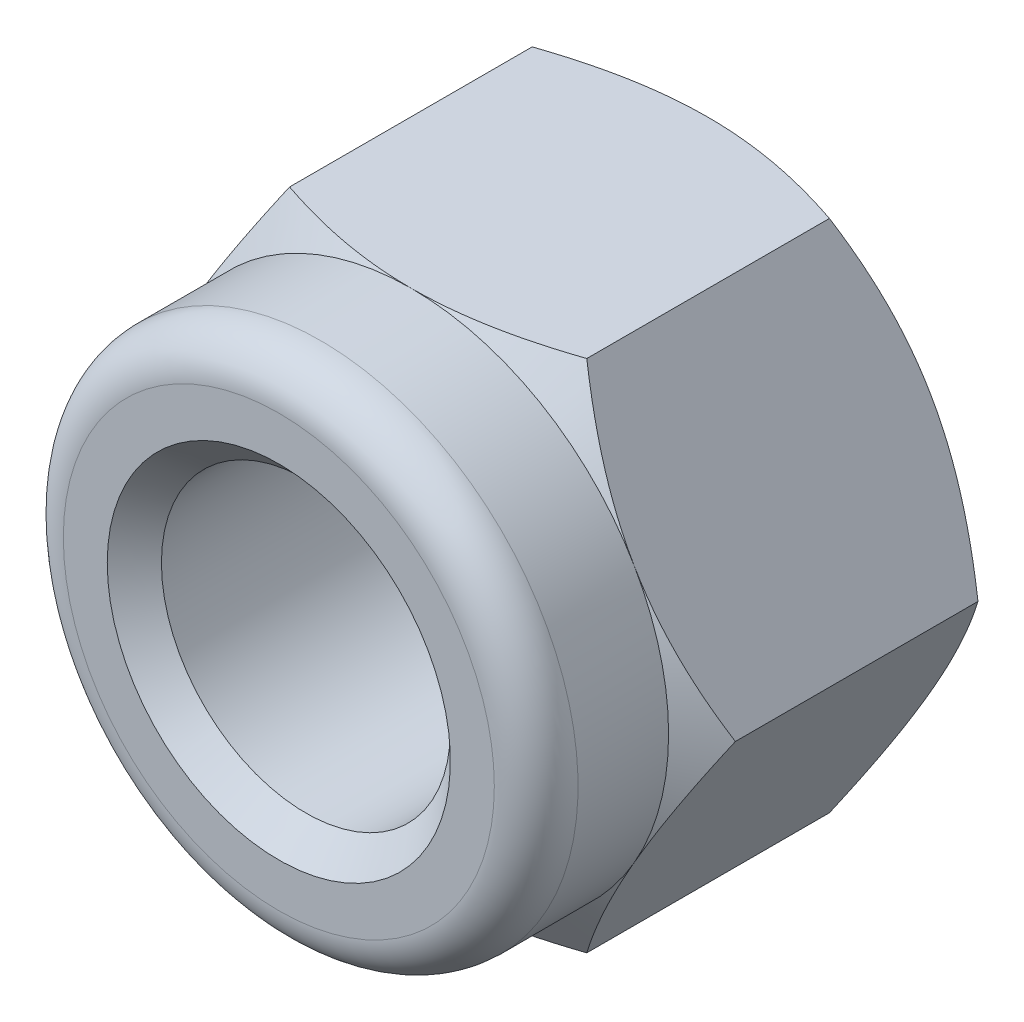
ISO-10303-21;
HEADER;
FILE_DESCRIPTION(('STEP AP214'),'2;1');
FILE_NAME('part.step','',(''),(''),'','','');
FILE_SCHEMA(('AUTOMOTIVE_DESIGN { 1 0 10303 214 1 1 1 1 }'));
ENDSEC;
DATA;
#1=APPLICATION_CONTEXT('core data for automotive mechanical design processes');
#2=APPLICATION_PROTOCOL_DEFINITION('international standard','automotive_design',2000,#1);
#3=PRODUCT_CONTEXT('',#1,'mechanical');
#4=PRODUCT('Part','Part','',(#3));
#5=PRODUCT_RELATED_PRODUCT_CATEGORY('part','',(#4));
#6=PRODUCT_DEFINITION_FORMATION('','',#4);
#7=PRODUCT_DEFINITION_CONTEXT('part definition',#1,'design');
#8=PRODUCT_DEFINITION('design','',#6,#7);
#9=PRODUCT_DEFINITION_SHAPE('','',#8);
#10=(LENGTH_UNIT() NAMED_UNIT(*) SI_UNIT(.MILLI.,.METRE.));
#11=(NAMED_UNIT(*) PLANE_ANGLE_UNIT() SI_UNIT($,.RADIAN.));
#12=(NAMED_UNIT(*) SI_UNIT($,.STERADIAN.) SOLID_ANGLE_UNIT());
#13=UNCERTAINTY_MEASURE_WITH_UNIT(LENGTH_MEASURE(1.E-05),#10,'distance_accuracy_value','');
#14=(GEOMETRIC_REPRESENTATION_CONTEXT(3) GLOBAL_UNCERTAINTY_ASSIGNED_CONTEXT((#13)) GLOBAL_UNIT_ASSIGNED_CONTEXT((#10,
#11,#12)) REPRESENTATION_CONTEXT('',''));
#15=CARTESIAN_POINT('',(0.,0.,0.));
#16=DIRECTION('',(0.,0.,1.));
#17=DIRECTION('',(1.,0.,0.));
#18=AXIS2_PLACEMENT_3D('',#15,#16,#17);
#19=CARTESIAN_POINT('',(-10.3923048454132,0.,10.37));
#20=DIRECTION('',(0.86602540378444,-0.499999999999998,0.));
#21=DIRECTION('',(0.499999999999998,0.86602540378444,0.));
#22=AXIS2_PLACEMENT_3D('',#19,#20,#21);
#23=PLANE('',#22);
#24=CARTESIAN_POINT('',(-10.3924203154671,-0.00019999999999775,9.42719454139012));
#25=CARTESIAN_POINT('',(-10.2764029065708,0.200748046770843,9.50574215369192));
#26=CARTESIAN_POINT('',(-10.1597703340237,0.402761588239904,9.58078081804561));
#27=CARTESIAN_POINT('',(-9.92519945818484,0.809050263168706,9.72275951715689));
#28=CARTESIAN_POINT('',(-9.80726035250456,1.01332678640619,9.78969423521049));
#29=CARTESIAN_POINT('',(-9.56974021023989,1.4247237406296,9.91449543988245));
#30=CARTESIAN_POINT('',(-9.45015489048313,1.63185159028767,9.97232958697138));
#31=CARTESIAN_POINT('',(-9.2098593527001,2.04805567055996,10.0774315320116));
#32=CARTESIAN_POINT('',(-9.08914949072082,2.25713128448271,10.1247025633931));
#33=CARTESIAN_POINT('',(-8.85083681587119,2.66990094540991,10.2061503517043));
#34=CARTESIAN_POINT('',(-8.73326753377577,2.87353691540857,10.2407169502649));
#35=CARTESIAN_POINT('',(-8.49740229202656,3.28206749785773,10.2980508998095));
#36=CARTESIAN_POINT('',(-8.37910631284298,3.4869621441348,10.3208179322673));
#37=CARTESIAN_POINT('',(-8.14228994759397,3.89714012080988,10.3538759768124));
#38=CARTESIAN_POINT('',(-8.0237703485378,4.10242208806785,10.3641893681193));
#39=CARTESIAN_POINT('',(-7.78662856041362,4.51316371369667,10.3721053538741));
#40=CARTESIAN_POINT('',(-7.66800637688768,4.71862336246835,10.3697085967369));
#41=CARTESIAN_POINT('',(-7.45072742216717,5.09496155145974,10.353732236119));
#42=CARTESIAN_POINT('',(-7.35203399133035,5.2659035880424,10.3420804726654));
#43=CARTESIAN_POINT('',(-7.15498835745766,5.60719663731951,10.3102495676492));
#44=CARTESIAN_POINT('',(-7.0566361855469,5.77754759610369,10.2900696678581));
#45=CARTESIAN_POINT('',(-6.76211080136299,6.28768052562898,10.2172283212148));
#46=CARTESIAN_POINT('',(-6.56667274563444,6.6261891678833,10.1522815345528));
#47=CARTESIAN_POINT('',(-6.17303719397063,7.30798594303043,9.99174825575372));
#48=CARTESIAN_POINT('',(-5.97492949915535,7.65111853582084,9.89531098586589));
#49=CARTESIAN_POINT('',(-5.58263770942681,8.3305878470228,9.6781246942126));
#50=CARTESIAN_POINT('',(-5.38844426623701,8.66694075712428,9.55744375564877));
#51=CARTESIAN_POINT('',(-5.19603695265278,9.0002,9.4271945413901));
#52=B_SPLINE_CURVE_WITH_KNOTS('',3,(#24,#25,#26,#27,#28,#29,#30,#31,#32,#33,#34,#35,#36,#37,#38,
#39,#40,#41,#42,#43,#44,#45,#46,#47,#48,#49,#50,#51),.UNSPECIFIED.,.F.,.F.,(4,2,2,2,2,2,2,2,2,2,
2,2,2,4),(0.,0.734939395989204,1.47035837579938,2.20833441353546,2.94608424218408,
3.65880420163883,4.37154339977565,5.08299988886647,5.79442008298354,6.38742131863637,
6.98047528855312,8.16780437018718,9.39031146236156,10.6094322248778),.UNSPECIFIED.);
#53=CARTESIAN_POINT('',(-10.3923048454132,0.,9.42727272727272));
#54=VERTEX_POINT('',#53);
#55=CARTESIAN_POINT('',(-7.79422863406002,4.50000000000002,10.37));
#56=VERTEX_POINT('',#55);
#57=EDGE_CURVE('E142',#54,#56,#52,.T.);
#58=ORIENTED_EDGE('',*,*,#57,.T.);
#59=CARTESIAN_POINT('',(-5.19615242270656,9.,9.42727272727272));
#60=VERTEX_POINT('',#59);
#61=EDGE_CURVE('E148',#56,#60,#52,.T.);
#62=ORIENTED_EDGE('',*,*,#61,.T.);
#63=DIRECTION('',(0.,0.,-1.));
#64=VECTOR('',#63,1.);
#65=CARTESIAN_POINT('',(-5.19615242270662,9.,10.37));
#66=LINE('',#65,#64);
#67=CARTESIAN_POINT('',(-5.19615242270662,9.,0.942727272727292));
#68=VERTEX_POINT('',#67);
#69=EDGE_CURVE('E232',#60,#68,#66,.T.);
#70=ORIENTED_EDGE('',*,*,#69,.T.);
#71=CARTESIAN_POINT('',(-5.19603695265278,9.0002,0.942805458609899));
#72=CARTESIAN_POINT('',(-5.31205436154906,8.79925195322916,0.864257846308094));
#73=CARTESIAN_POINT('',(-5.42868693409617,8.5972384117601,0.789219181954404));
#74=CARTESIAN_POINT('',(-5.66325780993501,8.19094973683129,0.647240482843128));
#75=CARTESIAN_POINT('',(-5.78119691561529,7.98667321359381,0.580305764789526));
#76=CARTESIAN_POINT('',(-6.01871705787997,7.5752762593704,0.455504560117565));
#77=CARTESIAN_POINT('',(-6.13830237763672,7.36814840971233,0.397670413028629));
#78=CARTESIAN_POINT('',(-6.37859791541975,6.95194432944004,0.292568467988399));
#79=CARTESIAN_POINT('',(-6.49930777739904,6.74286871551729,0.245297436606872));
#80=CARTESIAN_POINT('',(-6.73762045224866,6.33009905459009,0.1638496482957));
#81=CARTESIAN_POINT('',(-6.85518973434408,6.12646308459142,0.129283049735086));
#82=CARTESIAN_POINT('',(-7.0910549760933,5.71793250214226,0.0719491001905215));
#83=CARTESIAN_POINT('',(-7.20935095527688,5.5130378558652,0.0491820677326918));
#84=CARTESIAN_POINT('',(-7.44616732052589,5.10285987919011,0.0161240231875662));
#85=CARTESIAN_POINT('',(-7.56468691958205,4.89757791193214,0.00581063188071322));
#86=CARTESIAN_POINT('',(-7.80182870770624,4.48683628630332,-0.00210535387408));
#87=CARTESIAN_POINT('',(-7.92045089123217,4.28137663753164,0.000291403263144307));
#88=CARTESIAN_POINT('',(-8.13772984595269,3.90503844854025,0.0162677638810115));
#89=CARTESIAN_POINT('',(-8.23642327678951,3.73409641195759,0.0279195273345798));
#90=CARTESIAN_POINT('',(-8.43346891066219,3.39280336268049,0.059750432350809));
#91=CARTESIAN_POINT('',(-8.53182108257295,3.2224524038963,0.0799303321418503));
#92=CARTESIAN_POINT('',(-8.82634646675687,2.71231947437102,0.1527716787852));
#93=CARTESIAN_POINT('',(-9.02178452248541,2.37381083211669,0.217718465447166));
#94=CARTESIAN_POINT('',(-9.41542007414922,1.69201405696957,0.378251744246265));
#95=CARTESIAN_POINT('',(-9.6135277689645,1.34888146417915,0.47468901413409));
#96=CARTESIAN_POINT('',(-10.005819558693,0.669412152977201,0.691875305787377));
#97=CARTESIAN_POINT('',(-10.2000130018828,0.333059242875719,0.812556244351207));
#98=CARTESIAN_POINT('',(-10.3924203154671,-0.000199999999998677,0.942805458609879));
#99=B_SPLINE_CURVE_WITH_KNOTS('',3,(#71,#72,#73,#74,#75,#76,#77,#78,#79,#80,#81,#82,#83,#84,#85,
#86,#87,#88,#89,#90,#91,#92,#93,#94,#95,#96,#97,#98),.UNSPECIFIED.,.F.,.F.,(4,2,2,2,2,2,2,2,2,2,
2,2,2,4),(0.,0.734939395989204,1.47035837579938,2.20833441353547,2.94608424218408,
3.65880420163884,4.37154339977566,5.08299988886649,5.79442008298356,6.38742131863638,
6.98047528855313,8.16780437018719,9.39031146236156,10.6094322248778),.UNSPECIFIED.);
#100=CARTESIAN_POINT('',(-7.79422863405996,4.49999999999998,0.));
#101=VERTEX_POINT('',#100);
#102=EDGE_CURVE('E231',#68,#101,#99,.T.);
#103=ORIENTED_EDGE('',*,*,#102,.T.);
#104=CARTESIAN_POINT('',(-10.3923048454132,0.,0.942727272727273));
#105=VERTEX_POINT('',#104);
#106=EDGE_CURVE('E225',#101,#105,#99,.T.);
#107=ORIENTED_EDGE('',*,*,#106,.T.);
#108=DIRECTION('',(0.,0.,-1.));
#109=VECTOR('',#108,1.);
#110=CARTESIAN_POINT('',(-10.3923048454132,0.,10.37));
#111=LINE('',#110,#109);
#112=EDGE_CURVE('E241',#54,#105,#111,.T.);
#113=ORIENTED_EDGE('',*,*,#112,.F.);
#114=EDGE_LOOP('',(#58,#62,#70,#103,#107,#113));
#115=FACE_BOUND('',#114,.T.);
#116=ADVANCED_FACE('F31',(#115),#23,.F.);
#117=CARTESIAN_POINT('',(-5.19615242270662,-8.99999999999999,10.37));
#118=DIRECTION('',(0.86602540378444,0.499999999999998,0.));
#119=DIRECTION('',(-0.499999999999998,0.86602540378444,0.));
#120=AXIS2_PLACEMENT_3D('',#117,#118,#119);
#121=PLANE('',#120);
#122=CARTESIAN_POINT('',(-5.19603695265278,-9.00019999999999,9.4271945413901));
#123=CARTESIAN_POINT('',(-5.31205436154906,-8.79925195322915,9.50574215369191));
#124=CARTESIAN_POINT('',(-5.42868693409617,-8.59723841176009,9.58078081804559));
#125=CARTESIAN_POINT('',(-5.66325780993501,-8.19094973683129,9.72275951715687));
#126=CARTESIAN_POINT('',(-5.78119691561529,-7.9866732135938,9.78969423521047));
#127=CARTESIAN_POINT('',(-6.01871705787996,-7.5752762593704,9.91449543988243));
#128=CARTESIAN_POINT('',(-6.13830237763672,-7.36814840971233,9.97232958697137));
#129=CARTESIAN_POINT('',(-6.37859791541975,-6.95194432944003,10.0774315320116));
#130=CARTESIAN_POINT('',(-6.49930777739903,-6.74286871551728,10.1247025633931));
#131=CARTESIAN_POINT('',(-6.73762045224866,-6.33009905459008,10.2061503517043));
#132=CARTESIAN_POINT('',(-6.85518973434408,-6.12646308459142,10.2407169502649));
#133=CARTESIAN_POINT('',(-7.0910549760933,-5.71793250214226,10.2980508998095));
#134=CARTESIAN_POINT('',(-7.20935095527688,-5.51303785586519,10.3208179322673));
#135=CARTESIAN_POINT('',(-7.44616732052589,-5.10285987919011,10.3538759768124));
#136=CARTESIAN_POINT('',(-7.56468691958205,-4.89757791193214,10.3641893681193));
#137=CARTESIAN_POINT('',(-7.80182870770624,-4.48683628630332,10.3721053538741));
#138=CARTESIAN_POINT('',(-7.92045089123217,-4.28137663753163,10.3697085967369));
#139=CARTESIAN_POINT('',(-8.13772984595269,-3.90503844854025,10.353732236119));
#140=CARTESIAN_POINT('',(-8.23642327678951,-3.73409641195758,10.3420804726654));
#141=CARTESIAN_POINT('',(-8.43346891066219,-3.39280336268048,10.3102495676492));
#142=CARTESIAN_POINT('',(-8.53182108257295,-3.2224524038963,10.2900696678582));
#143=CARTESIAN_POINT('',(-8.82634646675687,-2.71231947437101,10.2172283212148));
#144=CARTESIAN_POINT('',(-9.02178452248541,-2.37381083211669,10.1522815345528));
#145=CARTESIAN_POINT('',(-9.41542007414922,-1.69201405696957,9.99174825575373));
#146=CARTESIAN_POINT('',(-9.6135277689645,-1.34888146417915,9.89531098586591));
#147=CARTESIAN_POINT('',(-10.005819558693,-0.669412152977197,9.67812469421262));
#148=CARTESIAN_POINT('',(-10.2000130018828,-0.333059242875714,9.55744375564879));
#149=CARTESIAN_POINT('',(-10.3924203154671,0.000200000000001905,9.42719454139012));
#150=B_SPLINE_CURVE_WITH_KNOTS('',3,(#122,#123,#124,#125,#126,#127,#128,#129,#130,#131,#132,
#133,#134,#135,#136,#137,#138,#139,#140,#141,#142,#143,#144,#145,#146,#147,#148,#149),
.UNSPECIFIED.,.F.,.F.,(4,2,2,2,2,2,2,2,2,2,2,2,2,4),(0.,0.734939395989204,1.47035837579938,
2.20833441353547,2.94608424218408,3.65880420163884,4.37154339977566,5.08299988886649,
5.79442008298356,6.38742131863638,6.98047528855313,8.16780437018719,9.39031146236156,
10.6094322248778),.UNSPECIFIED.);
#151=CARTESIAN_POINT('',(-5.19615242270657,-8.99999999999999,9.42727272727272));
#152=VERTEX_POINT('',#151);
#153=CARTESIAN_POINT('',(-7.79422863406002,-4.50000000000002,10.37));
#154=VERTEX_POINT('',#153);
#155=EDGE_CURVE('E196',#152,#154,#150,.T.);
#156=ORIENTED_EDGE('',*,*,#155,.T.);
#157=EDGE_CURVE('E191',#154,#54,#150,.T.);
#158=ORIENTED_EDGE('',*,*,#157,.T.);
#159=ORIENTED_EDGE('',*,*,#112,.T.);
#160=CARTESIAN_POINT('',(-10.3924203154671,0.00020000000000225,0.942805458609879));
#161=CARTESIAN_POINT('',(-10.2764029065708,-0.200748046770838,0.864257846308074));
#162=CARTESIAN_POINT('',(-10.1597703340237,-0.402761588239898,0.789219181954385));
#163=CARTESIAN_POINT('',(-9.92519945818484,-0.8090502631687,0.647240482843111));
#164=CARTESIAN_POINT('',(-9.80726035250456,-1.01332678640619,0.58030576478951));
#165=CARTESIAN_POINT('',(-9.56974021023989,-1.42472374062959,0.455504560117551));
#166=CARTESIAN_POINT('',(-9.45015489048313,-1.63185159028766,0.397670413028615));
#167=CARTESIAN_POINT('',(-9.2098593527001,-2.04805567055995,0.292568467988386));
#168=CARTESIAN_POINT('',(-9.08914949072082,-2.2571312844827,0.245297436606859));
#169=CARTESIAN_POINT('',(-8.85083681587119,-2.6699009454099,0.163849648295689));
#170=CARTESIAN_POINT('',(-8.73326753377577,-2.87353691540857,0.129283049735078));
#171=CARTESIAN_POINT('',(-8.49740229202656,-3.28206749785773,0.071949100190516));
#172=CARTESIAN_POINT('',(-8.37910631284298,-3.48696214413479,0.0491820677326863));
#173=CARTESIAN_POINT('',(-8.14228994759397,-3.89714012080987,0.0161240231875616));
#174=CARTESIAN_POINT('',(-8.0237703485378,-4.10242208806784,0.00581063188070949));
#175=CARTESIAN_POINT('',(-7.78662856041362,-4.51316371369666,-0.00210535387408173));
#176=CARTESIAN_POINT('',(-7.66800637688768,-4.71862336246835,0.000291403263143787));
#177=CARTESIAN_POINT('',(-7.45072742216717,-5.09496155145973,0.0162677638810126));
#178=CARTESIAN_POINT('',(-7.35203399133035,-5.2659035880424,0.0279195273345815));
#179=CARTESIAN_POINT('',(-7.15498835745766,-5.6071966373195,0.0597504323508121));
#180=CARTESIAN_POINT('',(-7.05663618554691,-5.77754759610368,0.0799303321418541));
#181=CARTESIAN_POINT('',(-6.76211080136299,-6.28768052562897,0.152771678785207));
#182=CARTESIAN_POINT('',(-6.56667274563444,-6.6261891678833,0.217718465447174));
#183=CARTESIAN_POINT('',(-6.17303719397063,-7.30798594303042,0.378251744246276));
#184=CARTESIAN_POINT('',(-5.97492949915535,-7.65111853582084,0.474689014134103));
#185=CARTESIAN_POINT('',(-5.58263770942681,-8.33058784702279,0.691875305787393));
#186=CARTESIAN_POINT('',(-5.38844426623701,-8.66694075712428,0.812556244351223));
#187=CARTESIAN_POINT('',(-5.19603695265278,-9.00019999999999,0.942805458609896));
#188=B_SPLINE_CURVE_WITH_KNOTS('',3,(#160,#161,#162,#163,#164,#165,#166,#167,#168,#169,#170,
#171,#172,#173,#174,#175,#176,#177,#178,#179,#180,#181,#182,#183,#184,#185,#186,#187),
.UNSPECIFIED.,.F.,.F.,(4,2,2,2,2,2,2,2,2,2,2,2,2,4),(0.,0.734939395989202,1.47035837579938,
2.20833441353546,2.94608424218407,3.65880420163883,4.37154339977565,5.08299988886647,
5.79442008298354,6.38742131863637,6.98047528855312,8.16780437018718,9.39031146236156,
10.6094322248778),.UNSPECIFIED.);
#189=CARTESIAN_POINT('',(-7.79422863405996,-4.49999999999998,0.));
#190=VERTEX_POINT('',#189);
#191=EDGE_CURVE('E218',#105,#190,#188,.T.);
#192=ORIENTED_EDGE('',*,*,#191,.T.);
#193=CARTESIAN_POINT('',(-5.19615242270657,-8.99999999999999,0.942727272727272));
#194=VERTEX_POINT('',#193);
#195=EDGE_CURVE('E211',#190,#194,#188,.T.);
#196=ORIENTED_EDGE('',*,*,#195,.T.);
#197=DIRECTION('',(0.,0.,-1.));
#198=VECTOR('',#197,1.);
#199=CARTESIAN_POINT('',(-5.19615242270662,-8.99999999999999,10.37));
#200=LINE('',#199,#198);
#201=EDGE_CURVE('E239',#152,#194,#200,.T.);
#202=ORIENTED_EDGE('',*,*,#201,.F.);
#203=EDGE_LOOP('',(#156,#158,#159,#192,#196,#202));
#204=FACE_BOUND('',#203,.T.);
#205=ADVANCED_FACE('F203',(#204),#121,.F.);
#206=CARTESIAN_POINT('',(5.19615242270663,-8.99999999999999,10.37));
#207=DIRECTION('',(0.,1.,0.));
#208=DIRECTION('',(-1.,0.,0.));
#209=AXIS2_PLACEMENT_3D('',#206,#207,#208);
#210=PLANE('',#209);
#211=CARTESIAN_POINT('',(-12.9103705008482,-9.,5.8078616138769));
#212=CARTESIAN_POINT('',(-12.5576292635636,-9.,6.00374062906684));
#213=CARTESIAN_POINT('',(-12.2038017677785,-9.,6.19769714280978));
#214=CARTESIAN_POINT('',(-11.4934395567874,-9.,6.58074550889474));
#215=CARTESIAN_POINT('',(-11.1369043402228,-9.,6.76983643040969));
#216=CARTESIAN_POINT('',(-10.4184762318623,-9.,7.14322782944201));
#217=CARTESIAN_POINT('',(-10.0565637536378,-8.99999999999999,7.32749075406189));
#218=CARTESIAN_POINT('',(-9.32901716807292,-8.99999999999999,7.68849112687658));
#219=CARTESIAN_POINT('',(-8.96338326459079,-8.99999999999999,7.86522898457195));
#220=CARTESIAN_POINT('',(-8.21373387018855,-8.99999999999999,8.21580595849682));
#221=CARTESIAN_POINT('',(-7.82954714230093,-8.99999999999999,8.38928095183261));
#222=CARTESIAN_POINT('',(-7.05549322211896,-8.99999999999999,8.72328625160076));
#223=CARTESIAN_POINT('',(-6.66562533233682,-8.99999999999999,8.88381495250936));
#224=CARTESIAN_POINT('',(-5.88027468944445,-8.99999999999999,9.18786206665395));
#225=CARTESIAN_POINT('',(-5.48480693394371,-8.99999999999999,9.33141880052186));
#226=CARTESIAN_POINT('',(-4.6868598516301,-8.99999999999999,9.59722561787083));
#227=CARTESIAN_POINT('',(-4.28438300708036,-8.99999999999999,9.71948308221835));
#228=CARTESIAN_POINT('',(-3.44391502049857,-8.99999999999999,9.94465852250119));
#229=CARTESIAN_POINT('',(-3.00539253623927,-8.99999999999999,10.0456546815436));
#230=CARTESIAN_POINT('',(-2.34237770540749,-8.99999999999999,10.1686377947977));
#231=CARTESIAN_POINT('',(-2.12049027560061,-8.99999999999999,10.2048813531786));
#232=CARTESIAN_POINT('',(-1.67528917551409,-8.99999999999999,10.2670774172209));
#233=CARTESIAN_POINT('',(-1.45197571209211,-8.99999999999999,10.2930313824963));
#234=CARTESIAN_POINT('',(-1.00791822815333,-8.99999999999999,10.3336849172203));
#235=CARTESIAN_POINT('',(-0.787190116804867,-8.99999999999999,10.3485575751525));
#236=CARTESIAN_POINT('',(-0.345267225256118,-8.99999999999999,10.3673453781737));
#237=CARTESIAN_POINT('',(-0.124072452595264,-8.99999999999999,10.3712606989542));
#238=CARTESIAN_POINT('',(0.318257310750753,-8.99999999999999,10.3680301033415));
#239=CARTESIAN_POINT('',(0.539392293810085,-8.99999999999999,10.3608831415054));
#240=CARTESIAN_POINT('',(0.98104140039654,-8.99999999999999,10.3357146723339));
#241=CARTESIAN_POINT('',(1.2015555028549,-8.99999999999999,10.3176928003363));
#242=CARTESIAN_POINT('',(1.68151380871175,-8.99999999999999,10.2669899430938));
#243=CARTESIAN_POINT('',(1.9407404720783,-8.99999999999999,10.2322382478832));
#244=CARTESIAN_POINT('',(2.45700905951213,-8.99999999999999,10.1492778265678));
#245=CARTESIAN_POINT('',(2.71405082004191,-8.99999999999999,10.1010681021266));
#246=CARTESIAN_POINT('',(3.48150607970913,-8.99999999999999,9.93822940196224));
#247=CARTESIAN_POINT('',(3.98812001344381,-8.99999999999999,9.80540581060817));
#248=CARTESIAN_POINT('',(4.74523791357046,-8.99999999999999,9.57660811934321));
#249=CARTESIAN_POINT('',(5.00008369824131,-8.99999999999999,9.49427979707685));
#250=CARTESIAN_POINT('',(5.50694625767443,-8.99999999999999,9.32126522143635));
#251=CARTESIAN_POINT('',(5.75896301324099,-8.99999999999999,9.23057891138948));
#252=CARTESIAN_POINT('',(6.2602352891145,-8.99999999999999,9.0420999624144));
#253=CARTESIAN_POINT('',(6.50949145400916,-8.99999999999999,8.94430902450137));
#254=CARTESIAN_POINT('',(7.00551982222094,-8.99999999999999,8.74264789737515));
#255=CARTESIAN_POINT('',(7.25229206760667,-8.99999999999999,8.63877781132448));
#256=CARTESIAN_POINT('',(7.88099884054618,-8.99999999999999,8.36630487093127));
#257=CARTESIAN_POINT('',(8.26132495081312,-8.99999999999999,8.19399300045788));
#258=CARTESIAN_POINT('',(9.01736070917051,-8.99999999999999,7.83948874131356));
#259=CARTESIAN_POINT('',(9.39306985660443,-8.99999999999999,7.65729529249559));
#260=CARTESIAN_POINT('',(10.1407286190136,-8.99999999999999,7.285013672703));
#261=CARTESIAN_POINT('',(10.512676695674,-8.99999999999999,7.09492242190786));
#262=CARTESIAN_POINT('',(11.2532804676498,-8.99999999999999,6.70848256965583));
#263=CARTESIAN_POINT('',(11.6219362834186,-8.99999999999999,6.5121341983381));
#264=CARTESIAN_POINT('',(12.357191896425,-8.99999999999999,6.11399000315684));
#265=CARTESIAN_POINT('',(12.7237864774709,-8.99999999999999,5.91218456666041));
#266=CARTESIAN_POINT('',(13.4546515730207,-8.99999999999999,5.50440899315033));
#267=CARTESIAN_POINT('',(13.8189220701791,-8.99999999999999,5.29843882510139));
#268=CARTESIAN_POINT('',(14.5454133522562,-8.99999999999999,4.88310473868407));
#269=CARTESIAN_POINT('',(14.9076345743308,-8.99999999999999,4.6737415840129));
#270=CARTESIAN_POINT('',(15.6304021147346,-8.99999999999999,4.25214204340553));
#271=CARTESIAN_POINT('',(15.9909484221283,-8.99999999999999,4.03990563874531));
#272=CARTESIAN_POINT('',(16.9984655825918,-8.99999999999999,3.44227966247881));
#273=CARTESIAN_POINT('',(17.6438365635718,-8.99999999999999,3.05419305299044));
#274=CARTESIAN_POINT('',(18.9310696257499,-8.99999999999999,2.27217411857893));
#275=CARTESIAN_POINT('',(19.5729314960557,-8.99999999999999,1.87824144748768));
#276=CARTESIAN_POINT('',(20.8512085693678,-8.99999999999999,1.08755581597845));
#277=CARTESIAN_POINT('',(21.4876353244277,-8.99999999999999,0.690821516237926));
#278=CARTESIAN_POINT('',(22.4406078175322,-8.99999999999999,0.093128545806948));
#279=CARTESIAN_POINT('',(22.7579732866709,-8.99999999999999,-0.106525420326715));
#280=CARTESIAN_POINT('',(23.3922113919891,-8.99999999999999,-0.506612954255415));
#281=CARTESIAN_POINT('',(23.7090840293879,-8.99999999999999,-0.707046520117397));
#282=CARTESIAN_POINT('',(24.0257377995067,-8.99999999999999,-0.907825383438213));
#283=B_SPLINE_CURVE_WITH_KNOTS('',3,(#211,#212,#213,#214,#215,#216,#217,#218,#219,#220,#221,
#222,#223,#224,#225,#226,#227,#228,#229,#230,#231,#232,#233,#234,#235,#236,#237,#238,#239,#240,
#241,#242,#243,#244,#245,#246,#247,#248,#249,#250,#251,#252,#253,#254,#255,#256,#257,#258,#259,
#260,#261,#262,#263,#264,#265,#266,#267,#268,#269,#270,#271,#272,#273,#274,#275,#276,#277,#278,
#279,#280,#281,#282),.UNSPECIFIED.,.F.,.F.,(4,2,2,2,2,2,2,2,2,2,2,2,2,2,2,2,2,2,2,2,2,2,2,2,2,2,
2,2,2,2,2,2,2,2,2,4),(0.,1.21045408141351,2.42113803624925,3.63942702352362,4.85764962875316,
6.12207221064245,7.38665135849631,8.64831838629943,9.90954733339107,11.2579864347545,
11.932269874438,12.6064576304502,13.2698802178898,13.9332921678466,14.5967668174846,
15.2602637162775,16.0444931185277,16.8287807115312,18.3977454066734,19.2011028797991,
20.0044658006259,20.8076370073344,21.6107945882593,22.8632166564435,24.1157733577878,
25.3688231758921,26.6218269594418,27.8772038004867,29.1325899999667,30.3876974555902,
31.6428130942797,33.9019774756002,36.1612761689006,38.4111350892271,39.5359644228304,
40.6607909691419),.UNSPECIFIED.);
#284=CARTESIAN_POINT('',(5.19615242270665,-8.99999999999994,9.42727272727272));
#285=VERTEX_POINT('',#284);
#286=CARTESIAN_POINT('',(0.,-9.,10.37));
#287=VERTEX_POINT('',#286);
#288=EDGE_CURVE('E309',#285,#287,#283,.F.);
#289=ORIENTED_EDGE('',*,*,#288,.T.);
#290=EDGE_CURVE('E197',#287,#152,#283,.F.);
#291=ORIENTED_EDGE('',*,*,#290,.T.);
#292=ORIENTED_EDGE('',*,*,#201,.T.);
#293=CARTESIAN_POINT('',(-12.9103705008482,-9.,4.56213838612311));
#294=CARTESIAN_POINT('',(-12.5576292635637,-9.,4.36625937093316));
#295=CARTESIAN_POINT('',(-12.2038017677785,-9.,4.17230285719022));
#296=CARTESIAN_POINT('',(-11.4934395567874,-9.,3.78925449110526));
#297=CARTESIAN_POINT('',(-11.1369043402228,-9.,3.60016356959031));
#298=CARTESIAN_POINT('',(-10.4184762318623,-9.,3.22677217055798));
#299=CARTESIAN_POINT('',(-10.0565637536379,-8.99999999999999,3.04250924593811));
#300=CARTESIAN_POINT('',(-9.32901716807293,-8.99999999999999,2.68150887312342));
#301=CARTESIAN_POINT('',(-8.9633832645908,-8.99999999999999,2.50477101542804));
#302=CARTESIAN_POINT('',(-8.21373387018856,-8.99999999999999,2.15419404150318));
#303=CARTESIAN_POINT('',(-7.82954714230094,-8.99999999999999,1.98071904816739));
#304=CARTESIAN_POINT('',(-7.05549322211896,-8.99999999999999,1.64671374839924));
#305=CARTESIAN_POINT('',(-6.66562533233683,-8.99999999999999,1.48618504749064));
#306=CARTESIAN_POINT('',(-5.88027468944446,-8.99999999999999,1.18213793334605));
#307=CARTESIAN_POINT('',(-5.48480693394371,-8.99999999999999,1.03858119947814));
#308=CARTESIAN_POINT('',(-4.6868598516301,-8.99999999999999,0.772774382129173));
#309=CARTESIAN_POINT('',(-4.28438300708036,-8.99999999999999,0.650516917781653));
#310=CARTESIAN_POINT('',(-3.44391502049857,-8.99999999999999,0.425341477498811));
#311=CARTESIAN_POINT('',(-3.00539253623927,-8.99999999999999,0.324345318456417));
#312=CARTESIAN_POINT('',(-2.34237770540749,-8.99999999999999,0.201362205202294));
#313=CARTESIAN_POINT('',(-2.12049027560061,-8.99999999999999,0.165118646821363));
#314=CARTESIAN_POINT('',(-1.67528917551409,-8.99999999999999,0.102922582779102));
#315=CARTESIAN_POINT('',(-1.45197571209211,-8.99999999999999,0.0769686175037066));
#316=CARTESIAN_POINT('',(-1.00791822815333,-8.99999999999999,0.0363150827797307));
#317=CARTESIAN_POINT('',(-0.787190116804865,-8.99999999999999,0.0214424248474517));
#318=CARTESIAN_POINT('',(-0.345267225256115,-8.99999999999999,0.00265462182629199));
#319=CARTESIAN_POINT('',(-0.124072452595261,-8.99999999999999,-0.00126069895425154));
#320=CARTESIAN_POINT('',(0.318257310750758,-8.99999999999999,0.00196989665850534));
#321=CARTESIAN_POINT('',(0.53939229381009,-8.99999999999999,0.00911685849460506));
#322=CARTESIAN_POINT('',(0.981041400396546,-8.99999999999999,0.0342853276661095));
#323=CARTESIAN_POINT('',(1.20155550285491,-8.99999999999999,0.052307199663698));
#324=CARTESIAN_POINT('',(1.68151380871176,-8.99999999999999,0.103010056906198));
#325=CARTESIAN_POINT('',(1.94074047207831,-8.99999999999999,0.137761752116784));
#326=CARTESIAN_POINT('',(2.45700905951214,-8.99999999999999,0.220722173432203));
#327=CARTESIAN_POINT('',(2.71405082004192,-8.99999999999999,0.268931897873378));
#328=CARTESIAN_POINT('',(3.48150607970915,-8.99999999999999,0.431770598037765));
#329=CARTESIAN_POINT('',(3.98812001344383,-8.99999999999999,0.564594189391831));
#330=CARTESIAN_POINT('',(4.74523791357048,-8.99999999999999,0.79339188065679));
#331=CARTESIAN_POINT('',(5.00008369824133,-8.99999999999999,0.875720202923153));
#332=CARTESIAN_POINT('',(5.50694625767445,-8.99999999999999,1.04873477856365));
#333=CARTESIAN_POINT('',(5.75896301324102,-8.99999999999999,1.13942108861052));
#334=CARTESIAN_POINT('',(6.26023528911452,-8.99999999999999,1.32790003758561));
#335=CARTESIAN_POINT('',(6.50949145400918,-8.99999999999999,1.42569097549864));
#336=CARTESIAN_POINT('',(7.00551982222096,-8.99999999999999,1.62735210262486));
#337=CARTESIAN_POINT('',(7.2522920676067,-8.99999999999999,1.73122218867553));
#338=CARTESIAN_POINT('',(7.88099884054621,-8.99999999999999,2.00369512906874));
#339=CARTESIAN_POINT('',(8.26132495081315,-8.99999999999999,2.17600699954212));
#340=CARTESIAN_POINT('',(9.01736070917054,-8.99999999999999,2.53051125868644));
#341=CARTESIAN_POINT('',(9.39306985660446,-8.99999999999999,2.71270470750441));
#342=CARTESIAN_POINT('',(10.1407286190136,-8.99999999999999,3.084986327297));
#343=CARTESIAN_POINT('',(10.5126766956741,-8.99999999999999,3.27507757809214));
#344=CARTESIAN_POINT('',(11.2532804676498,-8.99999999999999,3.66151743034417));
#345=CARTESIAN_POINT('',(11.6219362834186,-8.99999999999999,3.8578658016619));
#346=CARTESIAN_POINT('',(12.357191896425,-8.99999999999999,4.25600999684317));
#347=CARTESIAN_POINT('',(12.723786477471,-8.99999999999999,4.4578154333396));
#348=CARTESIAN_POINT('',(13.4546515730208,-8.99999999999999,4.86559100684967));
#349=CARTESIAN_POINT('',(13.8189220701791,-8.99999999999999,5.07156117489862));
#350=CARTESIAN_POINT('',(14.5454133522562,-8.99999999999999,5.48689526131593));
#351=CARTESIAN_POINT('',(14.9076345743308,-8.99999999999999,5.69625841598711));
#352=CARTESIAN_POINT('',(15.6304021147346,-8.99999999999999,6.11785795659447));
#353=CARTESIAN_POINT('',(15.9909484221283,-8.99999999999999,6.33009436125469));
#354=CARTESIAN_POINT('',(16.9984655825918,-8.99999999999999,6.92772033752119));
#355=CARTESIAN_POINT('',(17.6438365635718,-8.99999999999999,7.31580694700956));
#356=CARTESIAN_POINT('',(18.93106962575,-8.99999999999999,8.09782588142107));
#357=CARTESIAN_POINT('',(19.5729314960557,-8.99999999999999,8.49175855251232));
#358=CARTESIAN_POINT('',(20.8512085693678,-8.99999999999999,9.28244418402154));
#359=CARTESIAN_POINT('',(21.4876353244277,-8.99999999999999,9.67917848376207));
#360=CARTESIAN_POINT('',(22.4406078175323,-8.99999999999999,10.276871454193));
#361=CARTESIAN_POINT('',(22.757973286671,-8.99999999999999,10.4765254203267));
#362=CARTESIAN_POINT('',(23.3922113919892,-8.99999999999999,10.8766129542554));
#363=CARTESIAN_POINT('',(23.7090840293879,-8.99999999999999,11.0770465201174));
#364=CARTESIAN_POINT('',(24.0257377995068,-8.99999999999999,11.2778253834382));
#365=B_SPLINE_CURVE_WITH_KNOTS('',3,(#293,#294,#295,#296,#297,#298,#299,#300,#301,#302,#303,
#304,#305,#306,#307,#308,#309,#310,#311,#312,#313,#314,#315,#316,#317,#318,#319,#320,#321,#322,
#323,#324,#325,#326,#327,#328,#329,#330,#331,#332,#333,#334,#335,#336,#337,#338,#339,#340,#341,
#342,#343,#344,#345,#346,#347,#348,#349,#350,#351,#352,#353,#354,#355,#356,#357,#358,#359,#360,
#361,#362,#363,#364),.UNSPECIFIED.,.F.,.F.,(4,2,2,2,2,2,2,2,2,2,2,2,2,2,2,2,2,2,2,2,2,2,2,2,2,2,
2,2,2,2,2,2,2,2,2,4),(0.,1.21045408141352,2.42113803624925,3.63942702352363,4.85764962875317,
6.12207221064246,7.38665135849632,8.64831838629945,9.90954733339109,11.2579864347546,
11.932269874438,12.6064576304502,13.2698802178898,13.9332921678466,14.5967668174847,
15.2602637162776,16.0444931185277,16.8287807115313,18.3977454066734,19.2011028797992,
20.0044658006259,20.8076370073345,21.6107945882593,22.8632166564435,24.1157733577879,
25.3688231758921,26.6218269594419,27.8772038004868,29.1325899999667,30.3876974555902,
31.6428130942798,33.9019774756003,36.1612761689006,38.4111350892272,39.5359644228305,
40.660790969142),.UNSPECIFIED.);
#366=CARTESIAN_POINT('',(0.,-9.,0.));
#367=VERTEX_POINT('',#366);
#368=EDGE_CURVE('E219',#194,#367,#365,.T.);
#369=ORIENTED_EDGE('',*,*,#368,.T.);
#370=CARTESIAN_POINT('',(5.19615242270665,-8.99999999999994,0.942727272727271));
#371=VERTEX_POINT('',#370);
#372=EDGE_CURVE('E220',#367,#371,#365,.T.);
#373=ORIENTED_EDGE('',*,*,#372,.T.);
#374=DIRECTION('',(0.,0.,-1.));
#375=VECTOR('',#374,1.);
#376=CARTESIAN_POINT('',(5.19615242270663,-8.99999999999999,10.37));
#377=LINE('',#376,#375);
#378=EDGE_CURVE('E237',#285,#371,#377,.T.);
#379=ORIENTED_EDGE('',*,*,#378,.F.);
#380=EDGE_LOOP('',(#289,#291,#292,#369,#373,#379));
#381=FACE_BOUND('',#380,.T.);
#382=ADVANCED_FACE('F206',(#381),#210,.F.);
#383=CARTESIAN_POINT('',(10.3923048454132,0.,10.37));
#384=DIRECTION('',(-0.86602540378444,0.499999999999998,0.));
#385=DIRECTION('',(-0.499999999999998,-0.86602540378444,0.));
#386=AXIS2_PLACEMENT_3D('',#383,#384,#385);
#387=PLANE('',#386);
#388=CARTESIAN_POINT('',(10.3924203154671,0.000200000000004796,9.42719454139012));
#389=CARTESIAN_POINT('',(10.2764029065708,-0.200748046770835,9.50574215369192));
#390=CARTESIAN_POINT('',(10.1597703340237,-0.402761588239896,9.58078081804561));
#391=CARTESIAN_POINT('',(9.92519945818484,-0.809050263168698,9.72275951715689));
#392=CARTESIAN_POINT('',(9.80726035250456,-1.01332678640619,9.78969423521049));
#393=CARTESIAN_POINT('',(9.56974021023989,-1.42472374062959,9.91449543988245));
#394=CARTESIAN_POINT('',(9.45015489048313,-1.63185159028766,9.97232958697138));
#395=CARTESIAN_POINT('',(9.2098593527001,-2.04805567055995,10.0774315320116));
#396=CARTESIAN_POINT('',(9.08914949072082,-2.2571312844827,10.1247025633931));
#397=CARTESIAN_POINT('',(8.85083681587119,-2.6699009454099,10.2061503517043));
#398=CARTESIAN_POINT('',(8.73326753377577,-2.87353691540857,10.2407169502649));
#399=CARTESIAN_POINT('',(8.49740229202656,-3.28206749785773,10.2980508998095));
#400=CARTESIAN_POINT('',(8.37910631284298,-3.48696214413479,10.3208179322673));
#401=CARTESIAN_POINT('',(8.14228994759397,-3.89714012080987,10.3538759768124));
#402=CARTESIAN_POINT('',(8.0237703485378,-4.10242208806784,10.3641893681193));
#403=CARTESIAN_POINT('',(7.78662856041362,-4.51316371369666,10.3721053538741));
#404=CARTESIAN_POINT('',(7.66800637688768,-4.71862336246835,10.3697085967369));
#405=CARTESIAN_POINT('',(7.45072742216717,-5.09496155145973,10.353732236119));
#406=CARTESIAN_POINT('',(7.35203399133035,-5.2659035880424,10.3420804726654));
#407=CARTESIAN_POINT('',(7.15498835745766,-5.6071966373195,10.3102495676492));
#408=CARTESIAN_POINT('',(7.05663618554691,-5.77754759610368,10.2900696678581));
#409=CARTESIAN_POINT('',(6.76211080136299,-6.28768052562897,10.2172283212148));
#410=CARTESIAN_POINT('',(6.56667274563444,-6.62618916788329,10.1522815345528));
#411=CARTESIAN_POINT('',(6.17303719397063,-7.30798594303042,9.99174825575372));
#412=CARTESIAN_POINT('',(5.97492949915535,-7.65111853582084,9.8953109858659));
#413=CARTESIAN_POINT('',(5.58263770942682,-8.33058784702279,9.67812469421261));
#414=CARTESIAN_POINT('',(5.38844426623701,-8.66694075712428,9.55744375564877));
#415=CARTESIAN_POINT('',(5.19603695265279,-9.00019999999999,9.4271945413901));
#416=B_SPLINE_CURVE_WITH_KNOTS('',3,(#388,#389,#390,#391,#392,#393,#394,#395,#396,#397,#398,
#399,#400,#401,#402,#403,#404,#405,#406,#407,#408,#409,#410,#411,#412,#413,#414,#415),
.UNSPECIFIED.,.F.,.F.,(4,2,2,2,2,2,2,2,2,2,2,2,2,4),(0.,0.734939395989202,1.47035837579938,
2.20833441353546,2.94608424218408,3.65880420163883,4.37154339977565,5.08299988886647,
5.79442008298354,6.38742131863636,6.98047528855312,8.16780437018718,9.39031146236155,
10.6094322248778),.UNSPECIFIED.);
#417=CARTESIAN_POINT('',(10.3923048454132,0.,9.42727272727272));
#418=VERTEX_POINT('',#417);
#419=CARTESIAN_POINT('',(7.79422863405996,-4.49999999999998,10.37));
#420=VERTEX_POINT('',#419);
#421=EDGE_CURVE('E139',#418,#420,#416,.T.);
#422=ORIENTED_EDGE('',*,*,#421,.T.);
#423=EDGE_CURVE('E305',#420,#285,#416,.T.);
#424=ORIENTED_EDGE('',*,*,#423,.T.);
#425=ORIENTED_EDGE('',*,*,#378,.T.);
#426=CARTESIAN_POINT('',(5.19603695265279,-9.00019999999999,0.942805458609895));
#427=CARTESIAN_POINT('',(5.31205436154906,-8.79925195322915,0.86425784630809));
#428=CARTESIAN_POINT('',(5.42868693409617,-8.59723841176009,0.789219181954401));
#429=CARTESIAN_POINT('',(5.66325780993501,-8.19094973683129,0.647240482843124));
#430=CARTESIAN_POINT('',(5.78119691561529,-7.9866732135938,0.580305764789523));
#431=CARTESIAN_POINT('',(6.01871705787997,-7.5752762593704,0.455504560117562));
#432=CARTESIAN_POINT('',(6.13830237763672,-7.36814840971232,0.397670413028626));
#433=CARTESIAN_POINT('',(6.37859791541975,-6.95194432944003,0.292568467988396));
#434=CARTESIAN_POINT('',(6.49930777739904,-6.74286871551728,0.245297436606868));
#435=CARTESIAN_POINT('',(6.73762045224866,-6.33009905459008,0.163849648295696));
#436=CARTESIAN_POINT('',(6.85518973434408,-6.12646308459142,0.129283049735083));
#437=CARTESIAN_POINT('',(7.0910549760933,-5.71793250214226,0.0719491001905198));
#438=CARTESIAN_POINT('',(7.20935095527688,-5.51303785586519,0.0491820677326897));
#439=CARTESIAN_POINT('',(7.44616732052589,-5.10285987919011,0.0161240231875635));
#440=CARTESIAN_POINT('',(7.56468691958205,-4.89757791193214,0.00581063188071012));
#441=CARTESIAN_POINT('',(7.80182870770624,-4.48683628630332,-0.00210535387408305));
#442=CARTESIAN_POINT('',(7.92045089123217,-4.28137663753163,0.000291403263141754));
#443=CARTESIAN_POINT('',(8.13772984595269,-3.90503844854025,0.0162677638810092));
#444=CARTESIAN_POINT('',(8.23642327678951,-3.73409641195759,0.0279195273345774));
#445=CARTESIAN_POINT('',(8.43346891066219,-3.39280336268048,0.0597504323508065));
#446=CARTESIAN_POINT('',(8.53182108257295,-3.2224524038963,0.0799303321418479));
#447=CARTESIAN_POINT('',(8.82634646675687,-2.71231947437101,0.152771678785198));
#448=CARTESIAN_POINT('',(9.02178452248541,-2.37381083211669,0.217718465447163));
#449=CARTESIAN_POINT('',(9.41542007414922,-1.69201405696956,0.378251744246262));
#450=CARTESIAN_POINT('',(9.6135277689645,-1.34888146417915,0.474689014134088));
#451=CARTESIAN_POINT('',(10.005819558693,-0.669412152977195,0.691875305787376));
#452=CARTESIAN_POINT('',(10.2000130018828,-0.333059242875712,0.812556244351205));
#453=CARTESIAN_POINT('',(10.3924203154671,0.000200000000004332,0.942805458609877));
#454=B_SPLINE_CURVE_WITH_KNOTS('',3,(#426,#427,#428,#429,#430,#431,#432,#433,#434,#435,#436,
#437,#438,#439,#440,#441,#442,#443,#444,#445,#446,#447,#448,#449,#450,#451,#452,#453),
.UNSPECIFIED.,.F.,.F.,(4,2,2,2,2,2,2,2,2,2,2,2,2,4),(0.,0.734939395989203,1.47035837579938,
2.20833441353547,2.94608424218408,3.65880420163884,4.37154339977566,5.08299988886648,
5.79442008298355,6.38742131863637,6.98047528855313,8.16780437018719,9.39031146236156,
10.6094322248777),.UNSPECIFIED.);
#455=CARTESIAN_POINT('',(7.79422863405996,-4.49999999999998,0.));
#456=VERTEX_POINT('',#455);
#457=EDGE_CURVE('E323',#371,#456,#454,.T.);
#458=ORIENTED_EDGE('',*,*,#457,.T.);
#459=CARTESIAN_POINT('',(10.3923048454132,0.,0.942727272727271));
#460=VERTEX_POINT('',#459);
#461=EDGE_CURVE('E313',#456,#460,#454,.T.);
#462=ORIENTED_EDGE('',*,*,#461,.T.);
#463=DIRECTION('',(0.,0.,-1.));
#464=VECTOR('',#463,1.);
#465=CARTESIAN_POINT('',(10.3923048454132,0.,10.37));
#466=LINE('',#465,#464);
#467=EDGE_CURVE('E235',#418,#460,#466,.T.);
#468=ORIENTED_EDGE('',*,*,#467,.F.);
#469=EDGE_LOOP('',(#422,#424,#425,#458,#462,#468));
#470=FACE_BOUND('',#469,.T.);
#471=ADVANCED_FACE('F310',(#470),#387,.F.);
#472=CARTESIAN_POINT('',(5.19615242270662,9.,10.37));
#473=DIRECTION('',(-0.86602540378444,-0.499999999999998,0.));
#474=DIRECTION('',(0.499999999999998,-0.86602540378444,0.));
#475=AXIS2_PLACEMENT_3D('',#472,#473,#474);
#476=PLANE('',#475);
#477=CARTESIAN_POINT('',(5.19603695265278,9.0002,9.42719454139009));
#478=CARTESIAN_POINT('',(5.31205436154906,8.79925195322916,9.5057421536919));
#479=CARTESIAN_POINT('',(5.42868693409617,8.5972384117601,9.58078081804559));
#480=CARTESIAN_POINT('',(5.66325780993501,8.1909497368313,9.72275951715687));
#481=CARTESIAN_POINT('',(5.78119691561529,7.98667321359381,9.78969423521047));
#482=CARTESIAN_POINT('',(6.01871705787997,7.57527625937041,9.91449543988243));
#483=CARTESIAN_POINT('',(6.13830237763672,7.36814840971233,9.97232958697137));
#484=CARTESIAN_POINT('',(6.37859791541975,6.95194432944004,10.0774315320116));
#485=CARTESIAN_POINT('',(6.49930777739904,6.74286871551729,10.1247025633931));
#486=CARTESIAN_POINT('',(6.73762045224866,6.33009905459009,10.2061503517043));
#487=CARTESIAN_POINT('',(6.85518973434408,6.12646308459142,10.2407169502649));
#488=CARTESIAN_POINT('',(7.0910549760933,5.71793250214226,10.2980508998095));
#489=CARTESIAN_POINT('',(7.20935095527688,5.5130378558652,10.3208179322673));
#490=CARTESIAN_POINT('',(7.44616732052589,5.10285987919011,10.3538759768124));
#491=CARTESIAN_POINT('',(7.56468691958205,4.89757791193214,10.3641893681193));
#492=CARTESIAN_POINT('',(7.80182870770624,4.48683628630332,10.3721053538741));
#493=CARTESIAN_POINT('',(7.92045089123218,4.28137663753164,10.3697085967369));
#494=CARTESIAN_POINT('',(8.13772984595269,3.90503844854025,10.353732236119));
#495=CARTESIAN_POINT('',(8.23642327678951,3.73409641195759,10.3420804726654));
#496=CARTESIAN_POINT('',(8.43346891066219,3.39280336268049,10.3102495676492));
#497=CARTESIAN_POINT('',(8.53182108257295,3.2224524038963,10.2900696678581));
#498=CARTESIAN_POINT('',(8.82634646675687,2.71231947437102,10.2172283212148));
#499=CARTESIAN_POINT('',(9.02178452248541,2.37381083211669,10.1522815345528));
#500=CARTESIAN_POINT('',(9.41542007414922,1.69201405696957,9.99174825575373));
#501=CARTESIAN_POINT('',(9.6135277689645,1.34888146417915,9.89531098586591));
#502=CARTESIAN_POINT('',(10.005819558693,0.669412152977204,9.67812469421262));
#503=CARTESIAN_POINT('',(10.2000130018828,0.333059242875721,9.55744375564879));
#504=CARTESIAN_POINT('',(10.3924203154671,-0.000199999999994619,9.42719454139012));
#505=B_SPLINE_CURVE_WITH_KNOTS('',3,(#477,#478,#479,#480,#481,#482,#483,#484,#485,#486,#487,
#488,#489,#490,#491,#492,#493,#494,#495,#496,#497,#498,#499,#500,#501,#502,#503,#504),
.UNSPECIFIED.,.F.,.F.,(4,2,2,2,2,2,2,2,2,2,2,2,2,4),(0.,0.734939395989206,1.47035837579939,
2.20833441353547,2.94608424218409,3.65880420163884,4.37154339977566,5.08299988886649,
5.79442008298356,6.38742131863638,6.98047528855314,8.16780437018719,9.39031146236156,
10.6094322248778),.UNSPECIFIED.);
#506=CARTESIAN_POINT('',(5.19615242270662,9.,9.4272727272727));
#507=VERTEX_POINT('',#506);
#508=CARTESIAN_POINT('',(7.79422863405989,4.49999999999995,10.37));
#509=VERTEX_POINT('',#508);
#510=EDGE_CURVE('E46',#507,#509,#505,.T.);
#511=ORIENTED_EDGE('',*,*,#510,.T.);
#512=EDGE_CURVE('E137',#509,#418,#505,.T.);
#513=ORIENTED_EDGE('',*,*,#512,.T.);
#514=ORIENTED_EDGE('',*,*,#467,.T.);
#515=CARTESIAN_POINT('',(10.3924203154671,-0.000199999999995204,0.942805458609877));
#516=CARTESIAN_POINT('',(10.2764029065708,0.200748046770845,0.864257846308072));
#517=CARTESIAN_POINT('',(10.1597703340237,0.402761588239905,0.789219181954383));
#518=CARTESIAN_POINT('',(9.92519945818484,0.809050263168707,0.64724048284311));
#519=CARTESIAN_POINT('',(9.80726035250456,1.0133267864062,0.580305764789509));
#520=CARTESIAN_POINT('',(9.56974021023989,1.4247237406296,0.455504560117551));
#521=CARTESIAN_POINT('',(9.45015489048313,1.63185159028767,0.397670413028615));
#522=CARTESIAN_POINT('',(9.2098593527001,2.04805567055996,0.292568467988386));
#523=CARTESIAN_POINT('',(9.08914949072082,2.25713128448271,0.24529743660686));
#524=CARTESIAN_POINT('',(8.85083681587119,2.66990094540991,0.163849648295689));
#525=CARTESIAN_POINT('',(8.73326753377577,2.87353691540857,0.129283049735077));
#526=CARTESIAN_POINT('',(8.49740229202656,3.28206749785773,0.0719491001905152));
#527=CARTESIAN_POINT('',(8.37910631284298,3.4869621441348,0.0491820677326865));
#528=CARTESIAN_POINT('',(8.14228994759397,3.89714012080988,0.0161240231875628));
#529=CARTESIAN_POINT('',(8.0237703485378,4.10242208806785,0.0058106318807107));
#530=CARTESIAN_POINT('',(7.78662856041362,4.51316371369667,-0.00210535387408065));
#531=CARTESIAN_POINT('',(7.66800637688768,4.71862336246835,0.000291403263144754));
#532=CARTESIAN_POINT('',(7.45072742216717,5.09496155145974,0.0162677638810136));
#533=CARTESIAN_POINT('',(7.35203399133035,5.2659035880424,0.0279195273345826));
#534=CARTESIAN_POINT('',(7.15498835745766,5.60719663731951,0.0597504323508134));
#535=CARTESIAN_POINT('',(7.0566361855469,5.77754759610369,0.0799303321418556));
#536=CARTESIAN_POINT('',(6.76211080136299,6.28768052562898,0.152771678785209));
#537=CARTESIAN_POINT('',(6.56667274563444,6.6261891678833,0.217718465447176));
#538=CARTESIAN_POINT('',(6.17303719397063,7.30798594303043,0.378251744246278));
#539=CARTESIAN_POINT('',(5.97492949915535,7.65111853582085,0.474689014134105));
#540=CARTESIAN_POINT('',(5.58263770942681,8.3305878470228,0.691875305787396));
#541=CARTESIAN_POINT('',(5.38844426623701,8.66694075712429,0.812556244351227));
#542=CARTESIAN_POINT('',(5.19603695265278,9.0002,0.942805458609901));
#543=B_SPLINE_CURVE_WITH_KNOTS('',3,(#515,#516,#517,#518,#519,#520,#521,#522,#523,#524,#525,
#526,#527,#528,#529,#530,#531,#532,#533,#534,#535,#536,#537,#538,#539,#540,#541,#542),
.UNSPECIFIED.,.F.,.F.,(4,2,2,2,2,2,2,2,2,2,2,2,2,4),(0.,0.734939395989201,1.47035837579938,
2.20833441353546,2.94608424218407,3.65880420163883,4.37154339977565,5.08299988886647,
5.79442008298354,6.38742131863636,6.98047528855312,8.16780437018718,9.39031146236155,
10.6094322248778),.UNSPECIFIED.);
#544=CARTESIAN_POINT('',(7.79422863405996,4.49999999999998,0.));
#545=VERTEX_POINT('',#544);
#546=EDGE_CURVE('E316',#460,#545,#543,.T.);
#547=ORIENTED_EDGE('',*,*,#546,.T.);
#548=CARTESIAN_POINT('',(5.19615242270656,9.,0.942727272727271));
#549=VERTEX_POINT('',#548);
#550=EDGE_CURVE('E321',#545,#549,#543,.T.);
#551=ORIENTED_EDGE('',*,*,#550,.T.);
#552=DIRECTION('',(0.,0.,-1.));
#553=VECTOR('',#552,1.);
#554=CARTESIAN_POINT('',(5.19615242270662,9.,10.37));
#555=LINE('',#554,#553);
#556=EDGE_CURVE('E147',#507,#549,#555,.T.);
#557=ORIENTED_EDGE('',*,*,#556,.F.);
#558=EDGE_LOOP('',(#511,#513,#514,#547,#551,#557));
#559=FACE_BOUND('',#558,.T.);
#560=ADVANCED_FACE('F145',(#559),#476,.F.);
#561=CARTESIAN_POINT('',(-5.19615242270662,9.,10.37));
#562=DIRECTION('',(0.,-1.,0.));
#563=DIRECTION('',(1.,0.,0.));
#564=AXIS2_PLACEMENT_3D('',#561,#562,#563);
#565=PLANE('',#564);
#566=CARTESIAN_POINT('',(-12.9103705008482,9.,5.8078616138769));
#567=CARTESIAN_POINT('',(-12.5576292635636,9.,6.00374062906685));
#568=CARTESIAN_POINT('',(-12.2038017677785,9.,6.19769714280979));
#569=CARTESIAN_POINT('',(-11.4934395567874,9.,6.58074550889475));
#570=CARTESIAN_POINT('',(-11.1369043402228,9.,6.76983643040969));
#571=CARTESIAN_POINT('',(-10.4184762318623,9.,7.14322782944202));
#572=CARTESIAN_POINT('',(-10.0565637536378,9.,7.3274907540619));
#573=CARTESIAN_POINT('',(-9.32901716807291,9.,7.68849112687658));
#574=CARTESIAN_POINT('',(-8.96338326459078,9.,7.86522898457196));
#575=CARTESIAN_POINT('',(-8.21373387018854,9.,8.21580595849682));
#576=CARTESIAN_POINT('',(-7.82954714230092,9.,8.38928095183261));
#577=CARTESIAN_POINT('',(-7.05549322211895,9.,8.72328625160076));
#578=CARTESIAN_POINT('',(-6.66562533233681,9.,8.88381495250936));
#579=CARTESIAN_POINT('',(-5.88027468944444,9.,9.18786206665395));
#580=CARTESIAN_POINT('',(-5.4848069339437,9.,9.33141880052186));
#581=CARTESIAN_POINT('',(-4.68685985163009,9.,9.59722561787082));
#582=CARTESIAN_POINT('',(-4.28438300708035,9.,9.71948308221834));
#583=CARTESIAN_POINT('',(-3.44391502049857,9.,9.94465852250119));
#584=CARTESIAN_POINT('',(-3.00539253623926,9.,10.0456546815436));
#585=CARTESIAN_POINT('',(-2.34237770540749,9.,10.1686377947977));
#586=CARTESIAN_POINT('',(-2.12049027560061,9.,10.2048813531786));
#587=CARTESIAN_POINT('',(-1.6752891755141,9.,10.2670774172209));
#588=CARTESIAN_POINT('',(-1.45197571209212,9.,10.2930313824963));
#589=CARTESIAN_POINT('',(-1.00791822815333,9.,10.3336849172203));
#590=CARTESIAN_POINT('',(-0.787190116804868,9.,10.3485575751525));
#591=CARTESIAN_POINT('',(-0.34526722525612,9.,10.3673453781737));
#592=CARTESIAN_POINT('',(-0.124072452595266,9.,10.3712606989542));
#593=CARTESIAN_POINT('',(0.318257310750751,9.,10.3680301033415));
#594=CARTESIAN_POINT('',(0.539392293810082,9.,10.3608831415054));
#595=CARTESIAN_POINT('',(0.981041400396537,9.,10.3357146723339));
#596=CARTESIAN_POINT('',(1.2015555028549,9.,10.3176928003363));
#597=CARTESIAN_POINT('',(1.68151380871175,9.,10.2669899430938));
#598=CARTESIAN_POINT('',(1.9407404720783,9.,10.2322382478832));
#599=CARTESIAN_POINT('',(2.45700905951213,9.,10.1492778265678));
#600=CARTESIAN_POINT('',(2.71405082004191,9.,10.1010681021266));
#601=CARTESIAN_POINT('',(3.48150607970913,9.,9.93822940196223));
#602=CARTESIAN_POINT('',(3.98812001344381,9.,9.80540581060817));
#603=CARTESIAN_POINT('',(4.74523791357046,9.,9.57660811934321));
#604=CARTESIAN_POINT('',(5.00008369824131,9.,9.49427979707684));
#605=CARTESIAN_POINT('',(5.50694625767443,9.,9.32126522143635));
#606=CARTESIAN_POINT('',(5.75896301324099,9.,9.23057891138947));
#607=CARTESIAN_POINT('',(6.26023528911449,9.,9.04209996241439));
#608=CARTESIAN_POINT('',(6.50949145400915,9.,8.94430902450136));
#609=CARTESIAN_POINT('',(7.00551982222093,9.,8.74264789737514));
#610=CARTESIAN_POINT('',(7.25229206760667,9.,8.63877781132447));
#611=CARTESIAN_POINT('',(7.88099884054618,9.,8.36630487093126));
#612=CARTESIAN_POINT('',(8.26132495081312,9.,8.19399300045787));
#613=CARTESIAN_POINT('',(9.01736070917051,9.,7.83948874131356));
#614=CARTESIAN_POINT('',(9.39306985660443,9.,7.65729529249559));
#615=CARTESIAN_POINT('',(10.1407286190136,9.,7.285013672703));
#616=CARTESIAN_POINT('',(10.512676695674,9.,7.09492242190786));
#617=CARTESIAN_POINT('',(11.2532804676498,9.,6.70848256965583));
#618=CARTESIAN_POINT('',(11.6219362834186,9.,6.5121341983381));
#619=CARTESIAN_POINT('',(12.357191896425,9.,6.11399000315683));
#620=CARTESIAN_POINT('',(12.7237864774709,9.00000000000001,5.9121845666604));
#621=CARTESIAN_POINT('',(13.4546515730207,9.00000000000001,5.50440899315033));
#622=CARTESIAN_POINT('',(13.8189220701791,9.00000000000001,5.29843882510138));
#623=CARTESIAN_POINT('',(14.5454133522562,9.00000000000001,4.88310473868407));
#624=CARTESIAN_POINT('',(14.9076345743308,9.00000000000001,4.67374158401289));
#625=CARTESIAN_POINT('',(15.6304021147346,9.00000000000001,4.25214204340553));
#626=CARTESIAN_POINT('',(15.9909484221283,9.00000000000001,4.03990563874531));
#627=CARTESIAN_POINT('',(16.9984655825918,9.00000000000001,3.44227966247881));
#628=CARTESIAN_POINT('',(17.6438365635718,9.00000000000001,3.05419305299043));
#629=CARTESIAN_POINT('',(18.9310696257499,9.00000000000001,2.27217411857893));
#630=CARTESIAN_POINT('',(19.5729314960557,9.00000000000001,1.87824144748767));
#631=CARTESIAN_POINT('',(20.8512085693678,9.00000000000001,1.08755581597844));
#632=CARTESIAN_POINT('',(21.4876353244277,9.00000000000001,0.690821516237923));
#633=CARTESIAN_POINT('',(22.4406078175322,9.00000000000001,0.0931285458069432));
#634=CARTESIAN_POINT('',(22.7579732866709,9.00000000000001,-0.106525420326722));
#635=CARTESIAN_POINT('',(23.3922113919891,9.00000000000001,-0.506612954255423));
#636=CARTESIAN_POINT('',(23.7090840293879,9.00000000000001,-0.707046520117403));
#637=CARTESIAN_POINT('',(24.0257377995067,9.00000000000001,-0.907825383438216));
#638=B_SPLINE_CURVE_WITH_KNOTS('',3,(#566,#567,#568,#569,#570,#571,#572,#573,#574,#575,#576,
#577,#578,#579,#580,#581,#582,#583,#584,#585,#586,#587,#588,#589,#590,#591,#592,#593,#594,#595,
#596,#597,#598,#599,#600,#601,#602,#603,#604,#605,#606,#607,#608,#609,#610,#611,#612,#613,#614,
#615,#616,#617,#618,#619,#620,#621,#622,#623,#624,#625,#626,#627,#628,#629,#630,#631,#632,#633,
#634,#635,#636,#637),.UNSPECIFIED.,.F.,.F.,(4,2,2,2,2,2,2,2,2,2,2,2,2,2,2,2,2,2,2,2,2,2,2,2,2,2,
2,2,2,2,2,2,2,2,2,4),(0.,1.21045408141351,2.42113803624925,3.63942702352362,4.85764962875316,
6.12207221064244,7.3866513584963,8.64831838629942,9.90954733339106,11.2579864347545,
11.932269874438,12.6064576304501,13.2698802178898,13.9332921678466,14.5967668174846,
15.2602637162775,16.0444931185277,16.8287807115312,18.3977454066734,19.2011028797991,
20.0044658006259,20.8076370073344,21.6107945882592,22.8632166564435,24.1157733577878,
25.368823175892,26.6218269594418,27.8772038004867,29.1325899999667,30.3876974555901,
31.6428130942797,33.9019774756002,36.1612761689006,38.4111350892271,39.5359644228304,
40.6607909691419),.UNSPECIFIED.);
#639=CARTESIAN_POINT('',(0.,9.,10.37));
#640=VERTEX_POINT('',#639);
#641=EDGE_CURVE('E149',#60,#640,#638,.T.);
#642=ORIENTED_EDGE('',*,*,#641,.T.);
#643=EDGE_CURVE('E133',#640,#507,#638,.T.);
#644=ORIENTED_EDGE('',*,*,#643,.T.);
#645=ORIENTED_EDGE('',*,*,#556,.T.);
#646=CARTESIAN_POINT('',(-12.9103705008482,9.,4.5621383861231));
#647=CARTESIAN_POINT('',(-12.5576292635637,9.,4.36625937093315));
#648=CARTESIAN_POINT('',(-12.2038017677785,9.,4.17230285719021));
#649=CARTESIAN_POINT('',(-11.4934395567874,9.,3.78925449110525));
#650=CARTESIAN_POINT('',(-11.1369043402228,9.,3.60016356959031));
#651=CARTESIAN_POINT('',(-10.4184762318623,9.,3.22677217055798));
#652=CARTESIAN_POINT('',(-10.0565637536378,9.,3.0425092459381));
#653=CARTESIAN_POINT('',(-9.32901716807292,9.,2.68150887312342));
#654=CARTESIAN_POINT('',(-8.9633832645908,9.,2.50477101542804));
#655=CARTESIAN_POINT('',(-8.21373387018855,9.,2.15419404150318));
#656=CARTESIAN_POINT('',(-7.82954714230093,9.,1.98071904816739));
#657=CARTESIAN_POINT('',(-7.05549322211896,9.,1.64671374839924));
#658=CARTESIAN_POINT('',(-6.66562533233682,9.,1.48618504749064));
#659=CARTESIAN_POINT('',(-5.88027468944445,9.,1.18213793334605));
#660=CARTESIAN_POINT('',(-5.48480693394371,9.,1.03858119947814));
#661=CARTESIAN_POINT('',(-4.6868598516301,9.,0.772774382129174));
#662=CARTESIAN_POINT('',(-4.28438300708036,9.,0.650516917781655));
#663=CARTESIAN_POINT('',(-3.44391502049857,9.,0.425341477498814));
#664=CARTESIAN_POINT('',(-3.00539253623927,9.,0.32434531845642));
#665=CARTESIAN_POINT('',(-2.34237770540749,9.,0.201362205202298));
#666=CARTESIAN_POINT('',(-2.12049027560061,9.,0.165118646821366));
#667=CARTESIAN_POINT('',(-1.67528917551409,9.,0.102922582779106));
#668=CARTESIAN_POINT('',(-1.45197571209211,9.,0.0769686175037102));
#669=CARTESIAN_POINT('',(-1.00791822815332,9.,0.0363150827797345));
#670=CARTESIAN_POINT('',(-0.787190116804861,9.,0.0214424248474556));
#671=CARTESIAN_POINT('',(-0.345267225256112,9.,0.00265462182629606));
#672=CARTESIAN_POINT('',(-0.124072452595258,9.,-0.00126069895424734));
#673=CARTESIAN_POINT('',(0.31825731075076,9.,0.00196989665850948));
#674=CARTESIAN_POINT('',(0.539392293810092,9.,0.00911685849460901));
#675=CARTESIAN_POINT('',(0.981041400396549,9.,0.0342853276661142));
#676=CARTESIAN_POINT('',(1.20155550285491,9.,0.0523071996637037));
#677=CARTESIAN_POINT('',(1.68151380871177,9.,0.103010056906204));
#678=CARTESIAN_POINT('',(1.94074047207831,9.,0.13776175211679));
#679=CARTESIAN_POINT('',(2.45700905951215,9.,0.220722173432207));
#680=CARTESIAN_POINT('',(2.71405082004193,9.,0.268931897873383));
#681=CARTESIAN_POINT('',(3.48150607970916,9.,0.431770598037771));
#682=CARTESIAN_POINT('',(3.98812001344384,9.,0.564594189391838));
#683=CARTESIAN_POINT('',(4.74523791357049,9.,0.793391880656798));
#684=CARTESIAN_POINT('',(5.00008369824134,9.,0.875720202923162));
#685=CARTESIAN_POINT('',(5.50694625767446,9.,1.04873477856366));
#686=CARTESIAN_POINT('',(5.75896301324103,9.,1.13942108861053));
#687=CARTESIAN_POINT('',(6.26023528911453,9.,1.32790003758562));
#688=CARTESIAN_POINT('',(6.5094914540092,9.,1.42569097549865));
#689=CARTESIAN_POINT('',(7.00551982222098,9.,1.62735210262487));
#690=CARTESIAN_POINT('',(7.25229206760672,9.,1.73122218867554));
#691=CARTESIAN_POINT('',(7.88099884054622,9.,2.00369512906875));
#692=CARTESIAN_POINT('',(8.26132495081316,9.,2.17600699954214));
#693=CARTESIAN_POINT('',(9.01736070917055,9.,2.53051125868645));
#694=CARTESIAN_POINT('',(9.39306985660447,9.,2.71270470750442));
#695=CARTESIAN_POINT('',(10.1407286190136,9.,3.08498632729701));
#696=CARTESIAN_POINT('',(10.5126766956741,9.,3.27507757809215));
#697=CARTESIAN_POINT('',(11.2532804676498,9.,3.66151743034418));
#698=CARTESIAN_POINT('',(11.6219362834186,9.,3.85786580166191));
#699=CARTESIAN_POINT('',(12.3571918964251,9.,4.25600999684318));
#700=CARTESIAN_POINT('',(12.723786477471,9.00000000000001,4.45781543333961));
#701=CARTESIAN_POINT('',(13.4546515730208,9.00000000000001,4.86559100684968));
#702=CARTESIAN_POINT('',(13.8189220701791,9.00000000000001,5.07156117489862));
#703=CARTESIAN_POINT('',(14.5454133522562,9.00000000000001,5.48689526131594));
#704=CARTESIAN_POINT('',(14.9076345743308,9.00000000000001,5.69625841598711));
#705=CARTESIAN_POINT('',(15.6304021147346,9.00000000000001,6.11785795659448));
#706=CARTESIAN_POINT('',(15.9909484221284,9.00000000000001,6.3300943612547));
#707=CARTESIAN_POINT('',(16.9984655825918,9.00000000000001,6.92772033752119));
#708=CARTESIAN_POINT('',(17.6438365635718,9.00000000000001,7.31580694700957));
#709=CARTESIAN_POINT('',(18.93106962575,9.00000000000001,8.09782588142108));
#710=CARTESIAN_POINT('',(19.5729314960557,9.00000000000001,8.49175855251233));
#711=CARTESIAN_POINT('',(20.8512085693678,9.00000000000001,9.28244418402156));
#712=CARTESIAN_POINT('',(21.4876353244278,9.00000000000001,9.67917848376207));
#713=CARTESIAN_POINT('',(22.4406078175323,9.00000000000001,10.2768714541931));
#714=CARTESIAN_POINT('',(22.757973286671,9.00000000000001,10.4765254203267));
#715=CARTESIAN_POINT('',(23.3922113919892,9.00000000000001,10.8766129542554));
#716=CARTESIAN_POINT('',(23.7090840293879,9.00000000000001,11.0770465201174));
#717=CARTESIAN_POINT('',(24.0257377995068,9.00000000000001,11.2778253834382));
#718=B_SPLINE_CURVE_WITH_KNOTS('',3,(#646,#647,#648,#649,#650,#651,#652,#653,#654,#655,#656,
#657,#658,#659,#660,#661,#662,#663,#664,#665,#666,#667,#668,#669,#670,#671,#672,#673,#674,#675,
#676,#677,#678,#679,#680,#681,#682,#683,#684,#685,#686,#687,#688,#689,#690,#691,#692,#693,#694,
#695,#696,#697,#698,#699,#700,#701,#702,#703,#704,#705,#706,#707,#708,#709,#710,#711,#712,#713,
#714,#715,#716,#717),.UNSPECIFIED.,.F.,.F.,(4,2,2,2,2,2,2,2,2,2,2,2,2,2,2,2,2,2,2,2,2,2,2,2,2,2,
2,2,2,2,2,2,2,2,2,4),(0.,1.21045408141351,2.42113803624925,3.63942702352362,4.85764962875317,
6.12207221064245,7.38665135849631,8.64831838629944,9.90954733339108,11.2579864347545,
11.932269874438,12.6064576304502,13.2698802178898,13.9332921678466,14.5967668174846,
15.2602637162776,16.0444931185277,16.8287807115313,18.3977454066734,19.2011028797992,
20.0044658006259,20.8076370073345,21.6107945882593,22.8632166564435,24.1157733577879,
25.3688231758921,26.6218269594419,27.8772038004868,29.1325899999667,30.3876974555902,
31.6428130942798,33.9019774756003,36.1612761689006,38.4111350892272,39.5359644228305,
40.660790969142),.UNSPECIFIED.);
#719=CARTESIAN_POINT('',(0.,9.,0.));
#720=VERTEX_POINT('',#719);
#721=EDGE_CURVE('E324',#549,#720,#718,.F.);
#722=ORIENTED_EDGE('',*,*,#721,.T.);
#723=EDGE_CURVE('E329',#720,#68,#718,.F.);
#724=ORIENTED_EDGE('',*,*,#723,.T.);
#725=ORIENTED_EDGE('',*,*,#69,.F.);
#726=EDGE_LOOP('',(#642,#644,#645,#722,#724,#725));
#727=FACE_BOUND('',#726,.T.);
#728=ADVANCED_FACE('F343',(#727),#565,.F.);
#729=CARTESIAN_POINT('',(0.,0.,0.942727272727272));
#730=DIRECTION('',(0.,0.,1.));
#731=DIRECTION('',(1.,0.,0.));
#732=AXIS2_PLACEMENT_3D('',#729,#730,#731);
#733=CONICAL_SURFACE('',#732,10.3923048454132,0.9756065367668);
#734=CARTESIAN_POINT('',(0.,0.,0.));
#735=DIRECTION('',(0.,0.,1.));
#736=DIRECTION('',(1.,0.,0.));
#737=AXIS2_PLACEMENT_3D('',#734,#735,#736);
#738=CIRCLE('',#737,9.);
#739=EDGE_CURVE('E243',#545,#456,#738,.F.);
#740=ORIENTED_EDGE('',*,*,#739,.F.);
#741=ORIENTED_EDGE('',*,*,#546,.F.);
#742=ORIENTED_EDGE('',*,*,#461,.F.);
#743=EDGE_LOOP('',(#740,#741,#742));
#744=FACE_BOUND('',#743,.T.);
#745=ADVANCED_FACE('F319',(#744),#733,.T.);
#746=EDGE_CURVE('E245',#720,#545,#738,.F.);
#747=ORIENTED_EDGE('',*,*,#746,.F.);
#748=ORIENTED_EDGE('',*,*,#721,.F.);
#749=ORIENTED_EDGE('',*,*,#550,.F.);
#750=EDGE_LOOP('',(#747,#748,#749));
#751=FACE_BOUND('',#750,.T.);
#752=ADVANCED_FACE('F360',(#751),#733,.T.);
#753=ORIENTED_EDGE('',*,*,#723,.F.);
#754=CARTESIAN_POINT('',(0.,0.,0.));
#755=DIRECTION('',(0.,0.,-1.));
#756=DIRECTION('',(-1.,0.,0.));
#757=AXIS2_PLACEMENT_3D('',#754,#755,#756);
#758=CIRCLE('',#757,9.);
#759=EDGE_CURVE('E349',#101,#720,#758,.T.);
#760=ORIENTED_EDGE('',*,*,#759,.F.);
#761=ORIENTED_EDGE('',*,*,#102,.F.);
#762=EDGE_LOOP('',(#753,#760,#761));
#763=FACE_BOUND('',#762,.T.);
#764=ADVANCED_FACE('F178',(#763),#733,.T.);
#765=EDGE_CURVE('E361',#190,#101,#738,.F.);
#766=ORIENTED_EDGE('',*,*,#765,.F.);
#767=ORIENTED_EDGE('',*,*,#191,.F.);
#768=ORIENTED_EDGE('',*,*,#106,.F.);
#769=EDGE_LOOP('',(#766,#767,#768));
#770=FACE_BOUND('',#769,.T.);
#771=ADVANCED_FACE('F374',(#770),#733,.T.);
#772=EDGE_CURVE('E362',#367,#190,#738,.F.);
#773=ORIENTED_EDGE('',*,*,#772,.F.);
#774=ORIENTED_EDGE('',*,*,#368,.F.);
#775=ORIENTED_EDGE('',*,*,#195,.F.);
#776=EDGE_LOOP('',(#773,#774,#775));
#777=FACE_BOUND('',#776,.T.);
#778=ADVANCED_FACE('F372',(#777),#733,.T.);
#779=EDGE_CURVE('E54',#456,#367,#738,.F.);
#780=ORIENTED_EDGE('',*,*,#779,.F.);
#781=ORIENTED_EDGE('',*,*,#457,.F.);
#782=ORIENTED_EDGE('',*,*,#372,.F.);
#783=EDGE_LOOP('',(#780,#781,#782));
#784=FACE_BOUND('',#783,.T.);
#785=ADVANCED_FACE('F371',(#784),#733,.T.);
#786=CARTESIAN_POINT('',(-15.5884572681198,-9.,0.));
#787=DIRECTION('',(0.,0.,1.));
#788=DIRECTION('',(1.,0.,0.));
#789=AXIS2_PLACEMENT_3D('',#786,#787,#788);
#790=PLANE('',#789);
#791=CARTESIAN_POINT('',(0.,0.,0.));
#792=DIRECTION('',(0.,0.,1.));
#793=DIRECTION('',(1.,0.,0.));
#794=AXIS2_PLACEMENT_3D('',#791,#792,#793);
#795=CIRCLE('',#794,6.00000000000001);
#796=CARTESIAN_POINT('',(5.99999999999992,0.,0.));
#797=VERTEX_POINT('',#796);
#798=EDGE_CURVE('E11',#797,#797,#795,.T.);
#799=ORIENTED_EDGE('',*,*,#798,.T.);
#800=EDGE_LOOP('',(#799));
#801=FACE_BOUND('',#800,.T.);
#802=ORIENTED_EDGE('',*,*,#739,.T.);
#803=ORIENTED_EDGE('',*,*,#779,.T.);
#804=ORIENTED_EDGE('',*,*,#772,.T.);
#805=ORIENTED_EDGE('',*,*,#765,.T.);
#806=ORIENTED_EDGE('',*,*,#759,.T.);
#807=ORIENTED_EDGE('',*,*,#746,.T.);
#808=EDGE_LOOP('',(#802,#803,#804,#805,#806,#807));
#809=FACE_BOUND('',#808,.T.);
#810=ADVANCED_FACE('F368',(#801,#809),#790,.F.);
#811=CARTESIAN_POINT('',(0.,0.,10.37));
#812=DIRECTION('',(0.,0.,-1.));
#813=DIRECTION('',(-1.,0.,0.));
#814=AXIS2_PLACEMENT_3D('',#811,#812,#813);
#815=CONICAL_SURFACE('',#814,9.,0.975606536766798);
#816=ORIENTED_EDGE('',*,*,#512,.F.);
#817=CARTESIAN_POINT('',(0.,0.,10.37));
#818=DIRECTION('',(0.,0.,1.));
#819=DIRECTION('',(1.,0.,0.));
#820=AXIS2_PLACEMENT_3D('',#817,#818,#819);
#821=CIRCLE('',#820,9.);
#822=EDGE_CURVE('E122',#509,#420,#821,.F.);
#823=ORIENTED_EDGE('',*,*,#822,.T.);
#824=ORIENTED_EDGE('',*,*,#421,.F.);
#825=EDGE_LOOP('',(#816,#823,#824));
#826=FACE_BOUND('',#825,.T.);
#827=ADVANCED_FACE('F138',(#826),#815,.T.);
#828=ORIENTED_EDGE('',*,*,#643,.F.);
#829=EDGE_CURVE('E124',#640,#509,#821,.F.);
#830=ORIENTED_EDGE('',*,*,#829,.T.);
#831=ORIENTED_EDGE('',*,*,#510,.F.);
#832=EDGE_LOOP('',(#828,#830,#831));
#833=FACE_BOUND('',#832,.T.);
#834=ADVANCED_FACE('F132',(#833),#815,.T.);
#835=CARTESIAN_POINT('',(0.,0.,10.37));
#836=DIRECTION('',(0.,0.,-1.));
#837=DIRECTION('',(-1.,0.,0.));
#838=AXIS2_PLACEMENT_3D('',#835,#836,#837);
#839=CIRCLE('',#838,9.);
#840=EDGE_CURVE('E379',#56,#640,#839,.T.);
#841=ORIENTED_EDGE('',*,*,#840,.T.);
#842=ORIENTED_EDGE('',*,*,#641,.F.);
#843=ORIENTED_EDGE('',*,*,#61,.F.);
#844=EDGE_LOOP('',(#841,#842,#843));
#845=FACE_BOUND('',#844,.T.);
#846=ADVANCED_FACE('F378',(#845),#815,.T.);
#847=EDGE_CURVE('E135',#154,#56,#821,.F.);
#848=ORIENTED_EDGE('',*,*,#847,.T.);
#849=ORIENTED_EDGE('',*,*,#57,.F.);
#850=ORIENTED_EDGE('',*,*,#157,.F.);
#851=EDGE_LOOP('',(#848,#849,#850));
#852=FACE_BOUND('',#851,.T.);
#853=ADVANCED_FACE('F296',(#852),#815,.T.);
#854=EDGE_CURVE('E380',#287,#154,#821,.F.);
#855=ORIENTED_EDGE('',*,*,#854,.T.);
#856=ORIENTED_EDGE('',*,*,#155,.F.);
#857=ORIENTED_EDGE('',*,*,#290,.F.);
#858=EDGE_LOOP('',(#855,#856,#857));
#859=FACE_BOUND('',#858,.T.);
#860=ADVANCED_FACE('F175',(#859),#815,.T.);
#861=ORIENTED_EDGE('',*,*,#423,.F.);
#862=EDGE_CURVE('E126',#420,#287,#821,.F.);
#863=ORIENTED_EDGE('',*,*,#862,.T.);
#864=ORIENTED_EDGE('',*,*,#288,.F.);
#865=EDGE_LOOP('',(#861,#863,#864));
#866=FACE_BOUND('',#865,.T.);
#867=ADVANCED_FACE('F170',(#866),#815,.T.);
#868=CARTESIAN_POINT('',(0.,0.,15.));
#869=DIRECTION('',(0.,0.,-1.));
#870=DIRECTION('',(-1.,0.,0.));
#871=AXIS2_PLACEMENT_3D('',#868,#869,#870);
#872=CYLINDRICAL_SURFACE('',#871,9.);
#873=CARTESIAN_POINT('',(0.,0.,13.5359));
#874=DIRECTION('',(0.,0.,-1.));
#875=DIRECTION('',(-1.,0.,0.));
#876=AXIS2_PLACEMENT_3D('',#873,#874,#875);
#877=CIRCLE('',#876,9.);
#878=CARTESIAN_POINT('',(-9.00000000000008,0.,13.5359));
#879=VERTEX_POINT('',#878);
#880=EDGE_CURVE('E247',#879,#879,#877,.T.);
#881=ORIENTED_EDGE('',*,*,#880,.T.);
#882=EDGE_LOOP('',(#881));
#883=FACE_BOUND('',#882,.T.);
#884=ORIENTED_EDGE('',*,*,#822,.F.);
#885=ORIENTED_EDGE('',*,*,#829,.F.);
#886=ORIENTED_EDGE('',*,*,#840,.F.);
#887=ORIENTED_EDGE('',*,*,#847,.F.);
#888=ORIENTED_EDGE('',*,*,#854,.F.);
#889=ORIENTED_EDGE('',*,*,#862,.F.);
#890=EDGE_LOOP('',(#884,#885,#886,#887,#888,#889));
#891=FACE_BOUND('',#890,.T.);
#892=ADVANCED_FACE('F123',(#883,#891),#872,.T.);
#893=CARTESIAN_POINT('',(0.,0.,15.));
#894=DIRECTION('',(0.,0.,-1.));
#895=DIRECTION('',(-1.,0.,0.));
#896=AXIS2_PLACEMENT_3D('',#893,#894,#895);
#897=PLANE('',#896);
#898=CARTESIAN_POINT('',(0.,0.,15.));
#899=DIRECTION('',(0.,0.,-1.));
#900=DIRECTION('',(-1.,0.,0.));
#901=AXIS2_PLACEMENT_3D('',#898,#899,#900);
#902=CIRCLE('',#901,6.00000000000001);
#903=CARTESIAN_POINT('',(-6.00000000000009,0.,15.));
#904=VERTEX_POINT('',#903);
#905=EDGE_CURVE('E253',#904,#904,#902,.T.);
#906=ORIENTED_EDGE('',*,*,#905,.T.);
#907=EDGE_LOOP('',(#906));
#908=FACE_BOUND('',#907,.T.);
#909=CARTESIAN_POINT('',(0.,0.,15.));
#910=DIRECTION('',(0.,0.,-1.));
#911=DIRECTION('',(-1.,0.,0.));
#912=AXIS2_PLACEMENT_3D('',#909,#910,#911);
#913=CIRCLE('',#912,7.5359);
#914=CARTESIAN_POINT('',(-7.53590000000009,0.,15.));
#915=VERTEX_POINT('',#914);
#916=EDGE_CURVE('E250',#915,#915,#913,.F.);
#917=ORIENTED_EDGE('',*,*,#916,.T.);
#918=EDGE_LOOP('',(#917));
#919=FACE_BOUND('',#918,.T.);
#920=ADVANCED_FACE('F271',(#908,#919),#897,.F.);
#921=CARTESIAN_POINT('',(0.,0.,13.5359));
#922=DIRECTION('',(0.,0.,-1.));
#923=DIRECTION('',(-1.,0.,0.));
#924=AXIS2_PLACEMENT_3D('',#921,#922,#923);
#925=TOROIDAL_SURFACE('',#924,7.5359,1.4641);
#926=ORIENTED_EDGE('',*,*,#916,.F.);
#927=EDGE_LOOP('',(#926));
#928=FACE_BOUND('',#927,.T.);
#929=ORIENTED_EDGE('',*,*,#880,.F.);
#930=EDGE_LOOP('',(#929));
#931=FACE_BOUND('',#930,.T.);
#932=ADVANCED_FACE('F274',(#928,#931),#925,.T.);
#933=CARTESIAN_POINT('',(0.,0.,15.));
#934=DIRECTION('',(0.,0.,-1.));
#935=DIRECTION('',(-1.,0.,0.));
#936=AXIS2_PLACEMENT_3D('',#933,#934,#935);
#937=CYLINDRICAL_SURFACE('',#936,5.0528125);
#938=CARTESIAN_POINT('',(0.,0.,14.0528125));
#939=DIRECTION('',(0.,0.,-1.));
#940=DIRECTION('',(-1.,0.,0.));
#941=AXIS2_PLACEMENT_3D('',#938,#939,#940);
#942=CIRCLE('',#941,5.0528125);
#943=CARTESIAN_POINT('',(-5.05281250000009,0.,14.0528125));
#944=VERTEX_POINT('',#943);
#945=EDGE_CURVE('E39',#944,#944,#942,.F.);
#946=ORIENTED_EDGE('',*,*,#945,.T.);
#947=EDGE_LOOP('',(#946));
#948=FACE_BOUND('',#947,.T.);
#949=CARTESIAN_POINT('',(0.,0.,0.947187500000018));
#950=DIRECTION('',(0.,0.,1.));
#951=DIRECTION('',(1.,0.,0.));
#952=AXIS2_PLACEMENT_3D('',#949,#950,#951);
#953=CIRCLE('',#952,5.0528125);
#954=CARTESIAN_POINT('',(5.05281249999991,0.,0.947187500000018));
#955=VERTEX_POINT('',#954);
#956=EDGE_CURVE('E256',#955,#955,#953,.F.);
#957=ORIENTED_EDGE('',*,*,#956,.T.);
#958=EDGE_LOOP('',(#957));
#959=FACE_BOUND('',#958,.T.);
#960=ADVANCED_FACE('F261',(#948,#959),#937,.F.);
#961=CARTESIAN_POINT('',(0.,0.,15.));
#962=DIRECTION('',(0.,0.,1.));
#963=DIRECTION('',(1.,0.,0.));
#964=AXIS2_PLACEMENT_3D('',#961,#962,#963);
#965=CONICAL_SURFACE('',#964,6.00000000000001,0.785398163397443);
#966=ORIENTED_EDGE('',*,*,#945,.F.);
#967=EDGE_LOOP('',(#966));
#968=FACE_BOUND('',#967,.T.);
#969=ORIENTED_EDGE('',*,*,#905,.F.);
#970=EDGE_LOOP('',(#969));
#971=FACE_BOUND('',#970,.T.);
#972=ADVANCED_FACE('F264',(#968,#971),#965,.F.);
#973=CARTESIAN_POINT('',(0.,0.,0.947187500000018));
#974=DIRECTION('',(0.,0.,-1.));
#975=DIRECTION('',(-1.,0.,0.));
#976=AXIS2_PLACEMENT_3D('',#973,#974,#975);
#977=CONICAL_SURFACE('',#976,5.0528125,0.785398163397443);
#978=ORIENTED_EDGE('',*,*,#798,.F.);
#979=EDGE_LOOP('',(#978));
#980=FACE_BOUND('',#979,.T.);
#981=ORIENTED_EDGE('',*,*,#956,.F.);
#982=EDGE_LOOP('',(#981));
#983=FACE_BOUND('',#982,.T.);
#984=ADVANCED_FACE('F267',(#980,#983),#977,.F.);
#985=CLOSED_SHELL('',(#116,#205,#382,#471,#560,#728,#745,#752,#764,#771,#778,#785,#810,#827,
#834,#846,#853,#860,#867,#892,#920,#932,#960,#972,#984));
#986=MANIFOLD_SOLID_BREP('B2',#985);
#987=ADVANCED_BREP_SHAPE_REPRESENTATION('',(#18,#986),#14);
#988=SHAPE_DEFINITION_REPRESENTATION(#9,#987);
ENDSEC;
END-ISO-10303-21;
